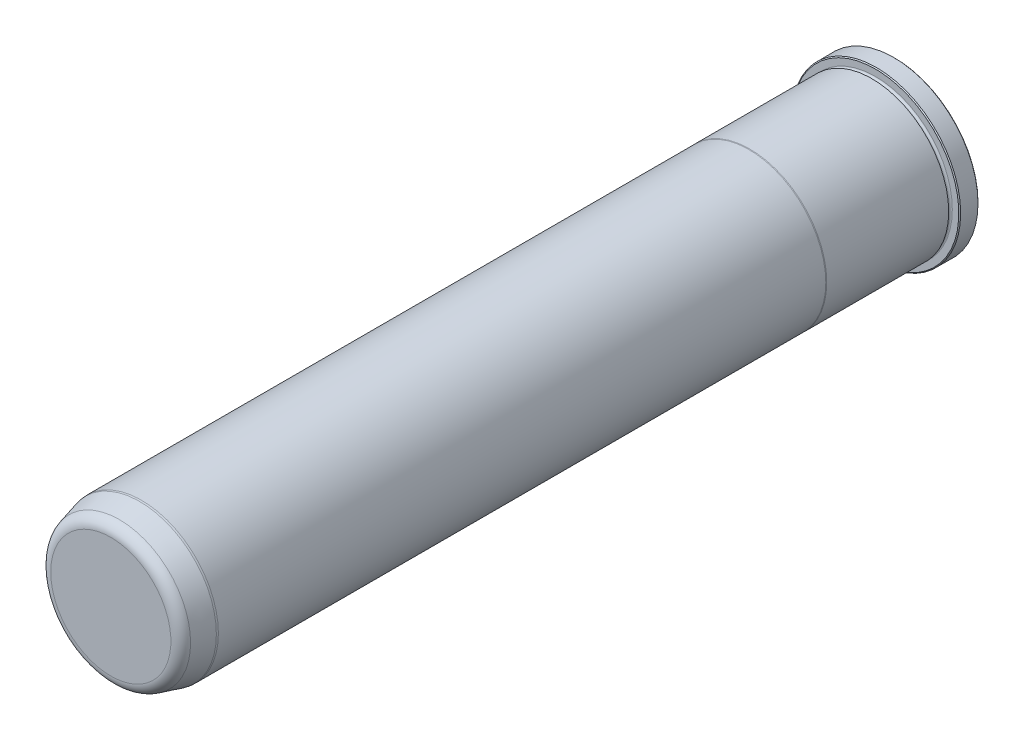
from build123d import *

# Parameters (mm, degrees)
FILLET6_R     = 4.7625
CHAMFER1_SIZE = 0.381


with BuildPart() as part:
    # Sketch1 → Revolve1 (revolve)
    with BuildSketch(Plane(origin=(0, 0, 0), x_dir=(0, 0, -1), z_dir=(1, 0, 0)), mode=Mode.PRIVATE) as revolve1_sk:
        with BuildLine():
            Line((0, 0), (0, 34.798))
            Line((0, 34.798), (-7.9248, 34.798))
            Line((-7.9248, 34.798), (-7.9248, 31.7373))
            ThreePointArc((-7.9248, 31.7373), (-8.6868, 30.9753), (-9.4488, 31.7373))
            Line((-9.4488, 31.7373), (-9.4488, 31.7627))
            Line((-9.4488, 31.7627), (-59.834763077, 31.7627))
            Line((-59.834763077, 31.7627), (-60.198, 31.7373))
            Line((-60.198, 31.7373), (-311.15, 31.7373))
            Line((-311.15, 31.7373), (-311.912, 31.670633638))
            Line((-311.912, 31.670633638), (-323.85, 28.471856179))
            Line((-323.85, 28.471856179), (-323.85, 0))
            Line((-323.85, 0), (0, 0))
        make_face()
    revolve(revolve1_sk.sketch.rotate(Axis((0, 0, 0), (0, 0, -1)), 90), axis=Axis((0, 0, 0), (0, 0, -1)))

    # Fillet6
    fillet6_edges = [part.edges().sort_by_distance(p)[0] for p in [
        (-28.471856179, 0, 323.85),
    ]]
    fillet(fillet6_edges, radius=FILLET6_R)

    # Chamfer1
    chamfer1_edges = [part.edges().sort_by_distance(p)[0] for p in [
        (-34.798, 0, 7.9248),
        (-34.798, 0, 0),
    ]]
    chamfer(chamfer1_edges, length=CHAMFER1_SIZE)


solid = part.part
